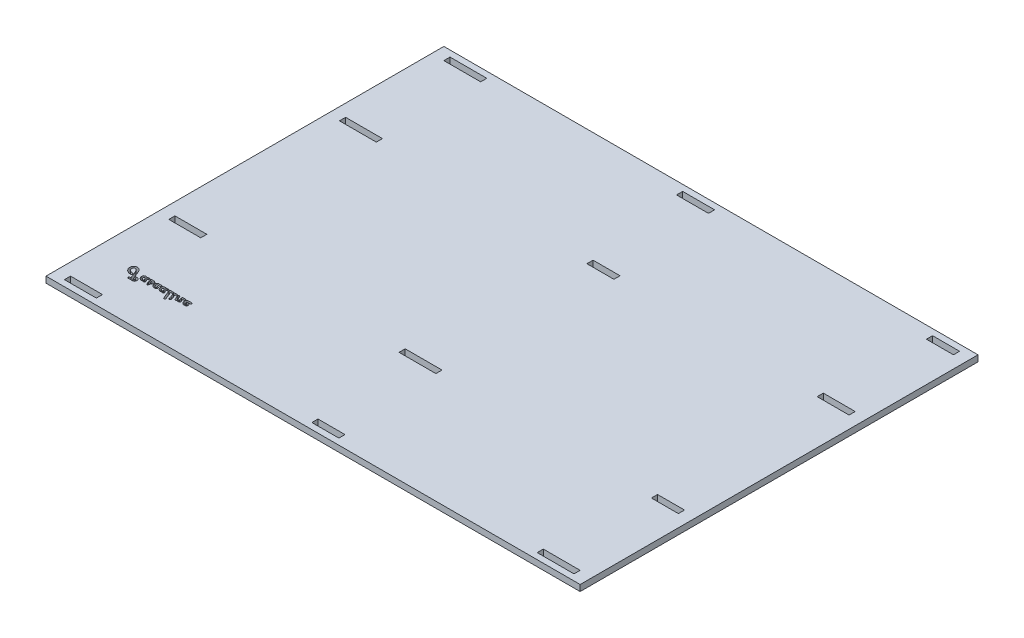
from build123d import *

# Parameters (mm, degrees)
SKETCH1_W           = 276.225
SKETCH1_H           = 205.74
SKETCH1_W_2         = 19.05
SKETCH1_H_2         = 3.175
SKETCH1_W_3         = 16.51
SKETCH1_W_4         = 13.97
BOSS_EXTRUDE1_DEPTH = 3.175
CUT_EXTRUDE1_DEPTH  = 345.440530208


with BuildPart() as part:
    # Sketch1 → Boss-Extrude1 (new body)
    with BuildSketch(Plane(origin=(0, 0, 0), x_dir=(1, 0, 0), z_dir=(0, 1, 0))):
        with Locations((138.1125, -102.87)):
            Rectangle(SKETCH1_W, SKETCH1_H)
        with Locations((15.875, -58.7375)):
            Rectangle(SKETCH1_W_2, SKETCH1_H_2, mode=Mode.SUBTRACT)
        with Locations((15.875, -4.7625)):
            Rectangle(SKETCH1_W_2, SKETCH1_H_2, mode=Mode.SUBTRACT)
        with Locations((134.9375, -4.7625)):
            Rectangle(SKETCH1_W_3, SKETCH1_H_2, mode=Mode.SUBTRACT)
        with Locations((262.89, -4.7625)):
            Rectangle(SKETCH1_W_4, SKETCH1_H_2, mode=Mode.SUBTRACT)
        with Locations((141.2875, -58.7375)):
            Rectangle(SKETCH1_W_4, SKETCH1_H_2, mode=Mode.SUBTRACT)
        with Locations((261.62, -58.7375)):
            Rectangle(SKETCH1_W_3, SKETCH1_H_2, mode=Mode.SUBTRACT)
        with Locations((14.605, -147.0025)):
            Rectangle(SKETCH1_W_3, SKETCH1_H_2, mode=Mode.SUBTRACT)
        with Locations((134.9375, -147.0025)):
            Rectangle(SKETCH1_W_2, SKETCH1_H_2, mode=Mode.SUBTRACT)
        with Locations((262.89, -147.0025)):
            Rectangle(SKETCH1_W_4, SKETCH1_H_2, mode=Mode.SUBTRACT)
        with Locations((14.605, -200.9775)):
            Rectangle(SKETCH1_W_3, SKETCH1_H_2, mode=Mode.SUBTRACT)
        with Locations((141.2875, -200.9775)):
            Rectangle(SKETCH1_W_4, SKETCH1_H_2, mode=Mode.SUBTRACT)
        with Locations((260.35, -200.9775)):
            Rectangle(SKETCH1_W_2, SKETCH1_H_2, mode=Mode.SUBTRACT)
    extrude(amount=BOSS_EXTRUDE1_DEPTH)

    # Sketch2 → Cut-Extrude1 (cut, through all)
    # profile 1 of 10: a face of its own
    with BuildSketch(Plane.XZ):
        with BuildLine():
            Line((23.119201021, 182.79452047), (22.451206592, 181.130477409))
            add(Edge.make_bspline(
                [(22.451206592, 181.130477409), (22.411003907, 181.031340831), (22.333829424, 180.841034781), (22.219435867, 180.568553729), (22.112680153, 180.320023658), (22.012786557, 180.095385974), (21.920717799, 179.893979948), (21.833533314, 179.717428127), (21.755963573, 179.563780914), (21.661354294, 179.39266641), (21.539114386, 179.202342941), (21.375027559, 178.99474829), (21.194459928, 178.802663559), (21.060129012, 178.689800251), (20.992791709, 178.633224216)],
                knots=[0, 0, 0, 0, 1.315970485, 2.526183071, 3.635244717, 4.643279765, 5.550454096, 6.359128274, 7.065363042, 7.667512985, 8.763908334, 9.843272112, 10.918877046, 12, 12, 12, 12], degree=3))
            add(Edge.make_bspline(
                [(20.992791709, 178.633224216), (20.941866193, 178.595142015), (20.841070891, 178.519767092), (20.680401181, 178.421962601), (20.514563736, 178.338383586), (20.341573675, 178.271585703), (20.163005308, 178.219327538), (19.978244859, 178.181172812), (19.787353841, 178.157947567), (19.658056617, 178.155470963), (19.592618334, 178.154217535)],
                knots=[0, 0, 0, 0, 1.011044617, 2.001129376, 2.987597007, 3.961339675, 4.946518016, 5.943976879, 6.959431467, 8, 8, 8, 8], degree=3))
            add(Edge.make_bspline(
                [(19.592618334, 178.154217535), (19.523985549, 178.155689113), (19.389812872, 178.158565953), (19.193870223, 178.18476624), (19.007122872, 178.223973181), (18.83078106, 178.283249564), (18.663334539, 178.356418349), (18.506601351, 178.447809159), (18.35966799, 178.554992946), (18.22480845, 178.678725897), (18.102569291, 178.814608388), (17.996369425, 178.961956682), (17.904994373, 179.118377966), (17.831448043, 179.285592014), (17.774055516, 179.462414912), (17.734367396, 179.648876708), (17.708307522, 179.84486499), (17.70541107, 179.979031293), (17.70392946, 180.047660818)],
                knots=[0, 0, 0, 0, 1.095039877, 2.140732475, 3.150521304, 4.13652018, 5.104897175, 6.062745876, 7.026672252, 8.00261995, 8.979018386, 9.939223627, 10.897072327, 11.865449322, 12.849478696, 13.859267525, 14.904960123, 16, 16, 16, 16], degree=3))
            add(Edge.make_bspline(
                [(17.70392946, 180.047660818), (17.706469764, 180.140106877), (17.711485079, 180.322622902), (17.750571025, 180.591864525), (17.814671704, 180.852395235), (17.905671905, 181.103879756), (18.021297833, 181.346741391), (18.16431112, 181.579480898), (18.332042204, 181.804170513), (18.460931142, 181.943030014), (18.526442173, 182.013608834)],
                knots=[0, 0, 0, 0, 1.01377589, 2.001495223, 2.977585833, 3.952291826, 4.930103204, 5.92294397, 6.944284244, 8, 8, 8, 8], degree=3))
            add(Edge.make_bspline(
                [(18.526442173, 182.013608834), (18.564038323, 182.050924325), (18.639923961, 182.126243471), (18.762383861, 182.231124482), (18.891389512, 182.331316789), (19.026342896, 182.426878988), (19.169837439, 182.513996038), (19.318539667, 182.598384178), (19.475608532, 182.674541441), (19.690708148, 182.771179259), (19.965425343, 182.870917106), (20.2978387, 182.958589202), (20.629749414, 183.011704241), (20.850767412, 183.019068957), (20.96069945, 183.02273209)],
                knots=[0, 0, 0, 0, 0.706155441, 1.425333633, 2.148189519, 2.883981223, 3.628821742, 4.385725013, 5.163077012, 5.955384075, 7.529784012, 9.053423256, 10.534403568, 12, 12, 12, 12], degree=3))
            add(Edge.make_bspline(
                [(20.96069945, 183.02273209), (21.010777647, 183.021540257), (21.10661754, 183.019259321), (21.242284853, 182.990920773), (21.363435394, 182.947665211), (21.467338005, 182.885588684), (21.552788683, 182.809995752), (21.616087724, 182.721046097), (21.653226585, 182.618989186), (21.657440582, 182.547193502), (21.659597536, 182.510444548)],
                knots=[0, 0, 0, 0, 1.238826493, 2.370872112, 3.417595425, 4.41258701, 5.350953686, 6.225146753, 7.091533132, 8, 8, 8, 8], degree=3))
            add(Edge.make_bspline(
                [(21.659597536, 182.510444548), (21.657158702, 182.47167473), (21.65240403, 182.396090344), (21.612518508, 182.288702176), (21.545055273, 182.194477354), (21.48423124, 182.145768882), (21.452780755, 182.120583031)],
                knots=[0, 0, 0, 0, 1.010937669, 1.970891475, 2.950802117, 4, 4, 4, 4], degree=3))
            add(Edge.make_bspline(
                [(21.452780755, 182.120583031), (21.428650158, 182.10617239), (21.374303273, 182.073716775), (21.271172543, 182.042998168), (21.142728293, 182.017208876), (21.04721528, 182.007184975), (20.995168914, 182.001722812)],
                knots=[0, 0, 0, 0, 0.704559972, 1.586808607, 2.68501851, 4, 4, 4, 4], degree=3))
            add(Edge.make_bspline(
                [(20.995168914, 182.001722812), (20.930899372, 181.995250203), (20.80556437, 181.982627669), (20.622961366, 181.953054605), (20.44919412, 181.919845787), (20.285218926, 181.876482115), (20.130183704, 181.827579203), (19.983692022, 181.774036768), (19.847574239, 181.710400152), (19.761927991, 181.662675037), (19.719798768, 181.639199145)],
                knots=[0, 0, 0, 0, 1.159710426, 2.261604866, 3.320677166, 4.335395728, 5.305245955, 6.239579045, 7.134052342, 8, 8, 8, 8], degree=3))
            add(Edge.make_bspline(
                [(19.719798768, 181.639199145), (19.654419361, 181.597250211), (19.52562533, 181.514612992), (19.354426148, 181.363133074), (19.203332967, 181.19487476), (19.075629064, 181.00902045), (18.973627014, 180.811182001), (18.89879096, 180.606164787), (18.852926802, 180.395180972), (18.847636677, 180.252322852), (18.844987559, 180.180784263)],
                knots=[0, 0, 0, 0, 1.047576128, 2.063670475, 3.075290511, 4.094745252, 5.099666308, 6.072755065, 7.034899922, 8, 8, 8, 8], degree=3))
            add(Edge.make_bspline(
                [(18.844987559, 180.180784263), (18.845636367, 180.145096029), (18.846908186, 180.075138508), (18.857899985, 179.973043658), (18.875018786, 179.87615749), (18.901788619, 179.785799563), (18.933862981, 179.700545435), (18.972695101, 179.620297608), (19.020918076, 179.546997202), (19.073977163, 179.478348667), (19.13513267, 179.418352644), (19.199905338, 179.364063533), (19.271326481, 179.320265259), (19.346543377, 179.282611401), (19.427352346, 179.25449148), (19.513023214, 179.234450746), (19.603256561, 179.220494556), (19.665464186, 179.219640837), (19.697215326, 179.219205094)],
                knots=[0, 0, 0, 0, 1.180906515, 2.314860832, 3.395146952, 4.432720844, 5.428859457, 6.408284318, 7.375873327, 8.328235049, 9.274073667, 10.205991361, 11.119268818, 12.040047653, 12.985704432, 13.943108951, 14.9501506, 16, 16, 16, 16], degree=3))
            add(Edge.make_bspline(
                [(19.697215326, 179.219205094), (19.73772721, 179.220089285), (19.817696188, 179.221834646), (19.934736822, 179.243468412), (20.047745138, 179.275266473), (20.156538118, 179.321036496), (20.261491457, 179.379435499), (20.361851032, 179.451340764), (20.457232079, 179.536749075), (20.550130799, 179.635601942), (20.640514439, 179.752163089), (20.735291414, 179.885231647), (20.829339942, 180.040578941), (20.926497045, 180.215206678), (21.026287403, 180.409494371), (21.128874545, 180.623606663), (21.231187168, 180.859081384), (21.299659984, 181.023020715), (21.335109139, 181.107893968)],
                knots=[0, 0, 0, 0, 0.731682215, 1.444313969, 2.14503258, 2.851587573, 3.573238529, 4.31284086, 5.079201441, 5.885132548, 6.76239785, 7.744387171, 8.838039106, 10.04403949, 11.357848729, 12.787140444, 14.336666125, 16, 16, 16, 16], degree=3))
            Line((21.335109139, 181.107893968), (22.730528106, 184.544142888))
            Line((22.730528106, 184.544142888), (22.293122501, 184.544142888))
            add(Edge.make_bspline(
                [(22.293122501, 184.544142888), (22.249482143, 184.54522865), (22.167784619, 184.547261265), (22.053469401, 184.563396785), (21.955911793, 184.590948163), (21.875553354, 184.631358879), (21.812083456, 184.683751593), (21.766552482, 184.748821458), (21.739607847, 184.826228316), (21.737016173, 184.881488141), (21.735668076, 184.910232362)],
                knots=[0, 0, 0, 0, 1.386647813, 2.595892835, 3.659749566, 4.594681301, 5.434731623, 6.248703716, 7.089037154, 8, 8, 8, 8], degree=3))
            add(Edge.make_bspline(
                [(21.735668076, 184.910232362), (21.737604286, 184.951372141), (21.741339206, 185.030730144), (21.780099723, 185.142032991), (21.841922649, 185.23923404), (21.930694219, 185.318386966), (22.040352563, 185.381488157), (22.17060237, 185.426231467), (22.320267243, 185.451690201), (22.426142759, 185.455156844), (22.482110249, 185.456989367)],
                knots=[0, 0, 0, 0, 0.942601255, 1.818263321, 2.674766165, 3.564433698, 4.523656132, 5.566505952, 6.713616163, 8, 8, 8, 8], degree=3))
            Line((22.482110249, 185.456989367), (24.009464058, 185.456989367))
            add(Edge.make_bspline(
                [(24.009464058, 185.456989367), (24.07248493, 185.45605179), (24.194705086, 185.454233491), (24.371659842, 185.440997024), (24.536158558, 185.420336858), (24.687661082, 185.389726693), (24.826003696, 185.349404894), (24.951704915, 185.300515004), (25.065549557, 185.244026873), (25.166457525, 185.176779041), (25.254881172, 185.100669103), (25.331318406, 185.014744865), (25.394973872, 184.919078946), (25.449869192, 184.814945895), (25.489653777, 184.699753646), (25.51766631, 184.575328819), (25.536143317, 184.441676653), (25.53815736, 184.349276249), (25.539195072, 184.301668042)],
                knots=[0, 0, 0, 0, 1.377685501, 2.671828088, 3.877302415, 5.000186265, 6.047243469, 7.023626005, 7.94558449, 8.820055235, 9.667510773, 10.489711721, 11.325757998, 12.174186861, 13.056345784, 13.980864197, 14.959664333, 16, 16, 16, 16], degree=3))
            add(Edge.make_bspline(
                [(25.539195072, 184.301668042), (25.537217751, 184.24294268), (25.533336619, 184.127675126), (25.507219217, 183.958719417), (25.461558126, 183.798497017), (25.398541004, 183.64601214), (25.315426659, 183.503066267), (25.215734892, 183.367351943), (25.098243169, 183.239446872), (25.007634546, 183.164349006), (24.961534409, 183.12614048)],
                knots=[0, 0, 0, 0, 1.037190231, 2.03582197, 3.010506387, 3.973515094, 4.942177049, 5.923321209, 6.943420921, 8, 8, 8, 8], degree=3))
            add(Edge.make_bspline(
                [(24.961534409, 183.12614048), (24.924861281, 183.099501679), (24.849567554, 183.044809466), (24.722279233, 182.977706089), (24.581294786, 182.920538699), (24.42582274, 182.874856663), (24.257052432, 182.838032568), (24.073914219, 182.812269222), (23.876613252, 182.796761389), (23.740077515, 182.795283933), (23.669523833, 182.79452047)],
                knots=[0, 0, 0, 0, 0.800437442, 1.643380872, 2.535600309, 3.486195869, 4.50417187, 5.586788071, 6.752993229, 8, 8, 8, 8], degree=3))
            Line((23.669523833, 182.79452047), (23.119201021, 182.79452047))
        make_face()
        with BuildLine():
            Line((23.509062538, 183.707366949), (23.833550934, 183.707366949))
            add(Edge.make_bspline(
                [(23.833550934, 183.707366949), (23.883581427, 183.708782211), (23.978009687, 183.711453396), (24.109812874, 183.735741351), (24.222265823, 183.777278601), (24.315221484, 183.83600151), (24.38842248, 183.91333287), (24.437974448, 184.00899527), (24.470358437, 184.119724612), (24.47287967, 184.199195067), (24.474207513, 184.241049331)],
                knots=[0, 0, 0, 0, 1.258971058, 2.376199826, 3.358208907, 4.260347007, 5.121448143, 6.005251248, 6.949436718, 8, 8, 8, 8], degree=3))
            add(Edge.make_bspline(
                [(24.474207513, 184.241049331), (24.473067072, 184.264903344), (24.470906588, 184.310093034), (24.45485612, 184.373529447), (24.424912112, 184.426356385), (24.384765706, 184.471207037), (24.331090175, 184.503760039), (24.267531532, 184.527978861), (24.192697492, 184.541857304), (24.139079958, 184.543348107), (24.110495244, 184.544142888)],
                knots=[0, 0, 0, 0, 1.057975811, 2.004258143, 2.869579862, 3.727735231, 4.644179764, 5.623179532, 6.73286349, 8, 8, 8, 8], degree=3))
            Line((24.110495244, 184.544142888), (23.84187115, 184.544142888))
            Line((23.84187115, 184.544142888), (23.509062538, 183.707366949))
        make_face(mode=Mode.SUBTRACT)
    # profile 2 of 10: a face of its own
    with BuildSketch(Plane.XZ):
        with BuildLine():
            Line((27.590722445, 180.892756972), (28.032882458, 180.892756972))
            add(Edge.make_bspline(
                [(28.032882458, 180.892756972), (28.069771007, 180.891594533), (28.139217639, 180.889406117), (28.237100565, 180.873955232), (28.319497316, 180.843823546), (28.389453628, 180.805117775), (28.441730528, 180.750669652), (28.479643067, 180.685580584), (28.502815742, 180.608611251), (28.504866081, 180.553382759), (28.505946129, 180.524290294)],
                knots=[0, 0, 0, 0, 1.294214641, 2.436497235, 3.45633191, 4.35958604, 5.214514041, 6.067746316, 6.982155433, 8, 8, 8, 8], degree=3))
            add(Edge.make_bspline(
                [(28.505946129, 180.524290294), (28.504075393, 180.483662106), (28.500488, 180.405751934), (28.467922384, 180.295389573), (28.411237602, 180.200597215), (28.335484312, 180.119531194), (28.239850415, 180.056616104), (28.127852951, 180.010515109), (27.999107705, 179.985437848), (27.90818237, 179.981811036), (27.860535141, 179.979910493)],
                knots=[0, 0, 0, 0, 1.02006706, 1.956119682, 2.85821293, 3.77438774, 4.72208319, 5.713685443, 6.801912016, 8, 8, 8, 8], degree=3))
            Line((27.860535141, 179.979910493), (27.347058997, 179.979910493))
            add(Edge.make_bspline(
                [(27.347058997, 179.979910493), (27.319272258, 179.980834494), (27.266140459, 179.982601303), (27.189661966, 179.995720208), (27.119931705, 180.018400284), (27.056725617, 180.050207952), (27.001086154, 180.09183418), (26.951568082, 180.140920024), (26.909321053, 180.199999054), (26.888358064, 180.244587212), (26.877561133, 180.267552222)],
                knots=[0, 0, 0, 0, 1.135602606, 2.17141737, 3.159933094, 4.123316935, 5.049777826, 5.988893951, 6.964185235, 8, 8, 8, 8], degree=3))
            add(Edge.make_bspline(
                [(26.877561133, 180.267552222), (26.829418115, 180.223702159), (26.738706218, 180.141079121), (26.589078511, 180.051827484), (26.442765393, 179.990628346), (26.343224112, 179.983401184), (26.295146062, 179.979910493)],
                knots=[0, 0, 0, 0, 1.172355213, 2.208971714, 3.134940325, 4, 4, 4, 4], degree=3))
            Line((26.295146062, 179.979910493), (25.838722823, 179.979910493))
            add(Edge.make_bspline(
                [(25.838722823, 179.979910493), (25.802613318, 179.98075717), (25.732080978, 179.982410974), (25.629021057, 179.997305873), (25.530996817, 180.02024658), (25.439134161, 180.055821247), (25.351766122, 180.098131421), (25.269891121, 180.15116498), (25.194345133, 180.214399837), (25.123714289, 180.285630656), (25.061392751, 180.365631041), (25.004824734, 180.450840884), (24.958631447, 180.543303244), (24.9203783, 180.641169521), (24.891018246, 180.744712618), (24.869013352, 180.853918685), (24.857836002, 180.969387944), (24.855668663, 181.048444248), (24.854560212, 181.088876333)],
                knots=[0, 0, 0, 0, 1.038881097, 2.029236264, 2.991883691, 3.930308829, 4.858629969, 5.782385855, 6.730121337, 7.689859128, 8.664191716, 9.644845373, 10.629272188, 11.633194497, 12.665607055, 13.723595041, 14.835769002, 16, 16, 16, 16], degree=3))
            add(Edge.make_bspline(
                [(24.854560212, 181.088876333), (24.85610135, 181.15077263), (24.859147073, 181.27309718), (24.885247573, 181.454146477), (24.926425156, 181.630157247), (24.985151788, 181.801314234), (25.060821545, 181.966769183), (25.150817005, 182.128417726), (25.260719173, 182.283187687), (25.383466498, 182.432189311), (25.517065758, 182.569321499), (25.65634466, 182.690858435), (25.801550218, 182.79213683), (25.949498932, 182.87771364), (26.103529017, 182.942119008), (26.26118757, 182.989085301), (26.423717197, 183.016977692), (26.533554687, 183.020807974), (26.588730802, 183.02273209)],
                knots=[0, 0, 0, 0, 1.038393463, 2.052158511, 3.063456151, 4.068635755, 5.08344709, 6.113632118, 7.168837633, 8.264602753, 9.350863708, 10.378663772, 11.361961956, 12.31789787, 13.241700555, 14.156967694, 15.07416527, 16, 16, 16, 16], degree=3))
            add(Edge.make_bspline(
                [(26.588730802, 183.02273209), (26.629955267, 183.021712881), (26.709847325, 183.019737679), (26.825936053, 183.007573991), (26.93284671, 182.982630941), (27.032648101, 182.953341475), (27.12225627, 182.910617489), (27.204008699, 182.860644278), (27.277694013, 182.801379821), (27.318416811, 182.753986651), (27.338738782, 182.730335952)],
                knots=[0, 0, 0, 0, 1.187749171, 2.30183041, 3.353985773, 4.346587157, 5.291117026, 6.203238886, 7.103359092, 8, 8, 8, 8], degree=3))
            add(Edge.make_bspline(
                [(27.338738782, 182.730335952), (27.355674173, 182.753711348), (27.388572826, 182.799120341), (27.444893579, 182.858946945), (27.505129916, 182.909541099), (27.568893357, 182.951846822), (27.638154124, 182.982068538), (27.709275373, 183.007094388), (27.78560771, 183.019744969), (27.837518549, 183.021720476), (27.864100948, 183.02273209)],
                knots=[0, 0, 0, 0, 1.102961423, 2.142610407, 3.131917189, 4.106850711, 5.056016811, 6.014208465, 6.983119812, 8, 8, 8, 8], degree=3))
            add(Edge.make_bspline(
                [(27.864100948, 183.02273209), (27.892332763, 183.021284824), (27.947568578, 183.018453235), (28.026788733, 182.99865781), (28.097661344, 182.962530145), (28.159912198, 182.915388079), (28.212990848, 182.859045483), (28.25007614, 182.793239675), (28.274365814, 182.721313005), (28.276592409, 182.670711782), (28.277734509, 182.644756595)],
                knots=[0, 0, 0, 0, 1.085152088, 2.123110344, 3.11068521, 4.121931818, 5.11360817, 6.061884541, 7.005870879, 8, 8, 8, 8], degree=3))
            add(Edge.make_bspline(
                [(28.277734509, 182.644756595), (28.277038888, 182.625686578), (28.275563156, 182.585230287), (28.262690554, 182.522308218), (28.242496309, 182.454251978), (28.223506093, 182.40846021), (28.213549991, 182.384452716)],
                knots=[0, 0, 0, 0, 0.847236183, 1.797378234, 2.845219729, 4, 4, 4, 4], degree=3))
            Line((28.213549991, 182.384452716), (28.16957171, 182.278667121))
            Line((28.16957171, 182.278667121), (27.590722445, 180.892756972))
        make_face()
        with BuildLine():
            Line((26.134684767, 180.892756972), (26.235715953, 180.892756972))
            add(Edge.make_bspline(
                [(26.235715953, 180.892756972), (26.261118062, 180.893313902), (26.310245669, 180.894391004), (26.380704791, 180.906223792), (26.444219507, 180.926536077), (26.501442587, 180.954060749), (26.551533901, 180.989991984), (26.595304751, 181.033437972), (26.631459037, 181.085632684), (26.649532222, 181.124621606), (26.658858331, 181.144740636)],
                knots=[0, 0, 0, 0, 1.157664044, 2.238919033, 3.244614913, 4.190073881, 5.122668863, 6.042574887, 6.989931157, 8, 8, 8, 8], degree=3))
            Line((26.658858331, 181.144740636), (26.92985963, 181.796094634))
            add(Edge.make_bspline(
                [(26.92985963, 181.796094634), (26.946051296, 181.834756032), (26.974847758, 181.903514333), (26.981585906, 181.977609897), (26.98453533, 182.010043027)],
                knots=[0, 0, 0, 0, 1.124559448, 2, 2, 2, 2], degree=3))
            add(Edge.make_bspline(
                [(26.98453533, 182.010043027), (26.982919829, 182.026420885), (26.979660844, 182.059460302), (26.960273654, 182.107946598), (26.923140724, 182.149283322), (26.877468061, 182.188201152), (26.822149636, 182.221159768), (26.759781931, 182.244753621), (26.692035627, 182.2595835), (26.645070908, 182.261194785), (26.620823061, 182.262026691)],
                knots=[0, 0, 0, 0, 0.81058345, 1.635208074, 2.524363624, 3.523748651, 4.593951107, 5.683817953, 6.804157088, 8, 8, 8, 8], degree=3))
            add(Edge.make_bspline(
                [(26.620823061, 182.262026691), (26.596174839, 182.261194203), (26.546394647, 182.25951289), (26.472572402, 182.243028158), (26.399545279, 182.218040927), (26.327079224, 182.182654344), (26.255132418, 182.137487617), (26.183183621, 182.082509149), (26.113420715, 182.016225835), (26.021876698, 181.918994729), (25.923002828, 181.78794112), (25.834330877, 181.622275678), (25.778103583, 181.452594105), (25.770947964, 181.337299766), (25.767406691, 181.280241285)],
                knots=[0, 0, 0, 0, 0.627706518, 1.267732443, 1.919531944, 2.592823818, 3.31892668, 4.082778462, 4.897707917, 5.769757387, 7.487317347, 9.064628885, 10.547302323, 12, 12, 12, 12], degree=3))
            add(Edge.make_bspline(
                [(25.767406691, 181.280241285), (25.768547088, 181.250053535), (25.770712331, 181.192736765), (25.786711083, 181.1124477), (25.814989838, 181.043784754), (25.857126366, 180.988202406), (25.910530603, 180.944732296), (25.97542406, 180.913075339), (26.051786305, 180.895788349), (26.106072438, 180.893803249), (26.134684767, 180.892756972)],
                knots=[0, 0, 0, 0, 1.183693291, 2.247450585, 3.194323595, 4.070859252, 4.954393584, 5.871857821, 6.878330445, 8, 8, 8, 8], degree=3))
        make_face(mode=Mode.SUBTRACT)
    # profile 3 of 10: a face of its own
    with BuildSketch(Plane.XZ):
        with BuildLine():
            Line((29.990510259, 181.960121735), (29.912062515, 181.790151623))
            add(Edge.make_bspline(
                [(29.912062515, 181.790151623), (29.896884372, 181.761223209), (29.86769618, 181.705592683), (29.814544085, 181.631320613), (29.757815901, 181.56745055), (29.695046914, 181.515760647), (29.628129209, 181.474518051), (29.555769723, 181.445719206), (29.478606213, 181.428787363), (29.425612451, 181.426445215), (29.39858637, 181.425250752)],
                knots=[0, 0, 0, 0, 1.174117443, 2.257875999, 3.277186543, 4.239058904, 5.172954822, 6.09414408, 7.028039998, 8, 8, 8, 8], degree=3))
            add(Edge.make_bspline(
                [(29.39858637, 181.425250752), (29.371134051, 181.426706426), (29.316667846, 181.429594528), (29.237096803, 181.450224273), (29.16263589, 181.485549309), (29.09462143, 181.532339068), (29.037107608, 181.588014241), (28.993789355, 181.649788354), (28.967174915, 181.716793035), (28.963967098, 181.763381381), (28.962369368, 181.786585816)],
                knots=[0, 0, 0, 0, 1.057292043, 2.097698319, 3.142574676, 4.21811325, 5.26521749, 6.20945791, 7.108177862, 8, 8, 8, 8], degree=3))
            add(Edge.make_bspline(
                [(28.962369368, 181.786585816), (28.963902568, 181.810895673), (28.967274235, 181.864355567), (28.992789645, 181.948344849), (29.027799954, 182.044307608), (29.061029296, 182.109427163), (29.078852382, 182.144355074)],
                knots=[0, 0, 0, 0, 0.768398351, 1.68978755, 2.760880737, 4, 4, 4, 4], degree=3))
            Line((29.078852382, 182.144355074), (29.612534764, 183.182004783))
            add(Edge.make_bspline(
                [(29.612534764, 183.182004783), (29.628998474, 183.211670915), (29.660355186, 183.268172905), (29.714608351, 183.34426393), (29.771846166, 183.408508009), (29.830813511, 183.463301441), (29.894697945, 183.504104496), (29.961322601, 183.533051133), (30.030689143, 183.551884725), (30.078349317, 183.554110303), (30.102238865, 183.555225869)],
                knots=[0, 0, 0, 0, 1.254889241, 2.390056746, 3.44940031, 4.435704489, 5.358962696, 6.23882182, 7.117213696, 8, 8, 8, 8], degree=3))
            add(Edge.make_bspline(
                [(30.102238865, 183.555225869), (30.127723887, 183.554244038), (30.177477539, 183.552327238), (30.249027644, 183.532558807), (30.314253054, 183.499927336), (30.371649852, 183.455530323), (30.422350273, 183.405018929), (30.456581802, 183.345159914), (30.480139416, 183.28158863), (30.482550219, 183.23689759), (30.483780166, 183.214097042)],
                knots=[0, 0, 0, 0, 1.076175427, 2.100985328, 3.113101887, 4.142426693, 5.162150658, 6.116677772, 7.039163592, 8, 8, 8, 8], degree=3))
            add(Edge.make_bspline(
                [(30.483780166, 183.214097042), (30.483189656, 183.206535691), (30.481707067, 183.187551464), (30.472108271, 183.154321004), (30.457923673, 183.110327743), (30.445526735, 183.077747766), (30.438613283, 183.059578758)],
                knots=[0, 0, 0, 0, 0.562304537, 1.411773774, 2.556613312, 4, 4, 4, 4], degree=3))
            add(Edge.make_bspline(
                [(30.438613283, 183.059578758), (30.429934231, 183.032065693), (30.4139082, 182.981262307), (30.409658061, 182.928198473), (30.407709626, 182.903871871)],
                knots=[0, 0, 0, 0, 1.083119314, 2, 2, 2, 2], degree=3))
            add(Edge.make_bspline(
                [(30.407709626, 182.903871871), (30.410360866, 182.861582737), (30.41576673, 182.775355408), (30.457407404, 182.64653534), (30.521341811, 182.516045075), (30.581783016, 182.435055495), (30.613337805, 182.392772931)],
                knots=[0, 0, 0, 0, 0.903479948, 1.84219102, 2.873463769, 4, 4, 4, 4], degree=3))
            Line((30.613337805, 182.392772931), (30.862944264, 182.078981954))
            add(Edge.make_bspline(
                [(30.862944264, 182.078981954), (30.89315876, 182.039323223), (30.95181765, 181.962329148), (31.029517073, 181.84355279), (31.096639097, 181.726600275), (31.150204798, 181.609464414), (31.192582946, 181.493521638), (31.222000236, 181.378436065), (31.241056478, 181.264233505), (31.243346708, 181.188395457), (31.244485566, 181.150683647)],
                knots=[0, 0, 0, 0, 1.169686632, 2.270847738, 3.328397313, 4.331060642, 5.289870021, 6.221237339, 7.115478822, 8, 8, 8, 8], degree=3))
            add(Edge.make_bspline(
                [(31.244485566, 181.150683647), (31.243374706, 181.109809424), (31.241185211, 181.029246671), (31.222953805, 180.911259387), (31.193158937, 180.79845238), (31.151222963, 180.690841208), (31.097710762, 180.58819061), (31.031457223, 180.491251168), (30.953690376, 180.399354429), (30.865170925, 180.313590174), (30.768195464, 180.234785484), (30.663003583, 180.167811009), (30.55370701, 180.108252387), (30.437152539, 180.062572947), (30.315721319, 180.025019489), (30.188203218, 179.99984317), (30.055210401, 179.981754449), (29.964426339, 179.980534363), (29.918005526, 179.979910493)],
                knots=[0, 0, 0, 0, 0.993241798, 1.957671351, 2.894532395, 3.824635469, 4.759513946, 5.702543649, 6.673110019, 7.681185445, 8.695042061, 9.70491044, 10.708882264, 11.715852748, 12.742665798, 13.794825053, 14.872423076, 16, 16, 16, 16], degree=3))
            Line((29.918005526, 179.979910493), (29.080040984, 179.979910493))
            add(Edge.make_bspline(
                [(29.080040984, 179.979910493), (29.041166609, 179.981059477), (28.968164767, 179.983217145), (28.865667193, 179.998710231), (28.778850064, 180.028517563), (28.70672086, 180.068926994), (28.649687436, 180.12138835), (28.609138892, 180.186520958), (28.58673032, 180.26416277), (28.583643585, 180.319310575), (28.582016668, 180.348377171)],
                knots=[0, 0, 0, 0, 1.323532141, 2.485449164, 3.513452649, 4.431917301, 5.281225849, 6.123328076, 7.010867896, 8, 8, 8, 8], degree=3))
            add(Edge.make_bspline(
                [(28.582016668, 180.348377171), (28.583766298, 180.389042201), (28.587126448, 180.46713907), (28.621444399, 180.577312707), (28.678777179, 180.672470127), (28.758030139, 180.752372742), (28.857096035, 180.814960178), (28.972704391, 180.862237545), (29.105937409, 180.887233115), (29.199599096, 180.890854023), (29.248822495, 180.892756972)],
                knots=[0, 0, 0, 0, 1.001377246, 1.923137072, 2.813709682, 3.719614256, 4.674449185, 5.687788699, 6.784829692, 8, 8, 8, 8], degree=3))
            Line((29.248822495, 180.892756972), (29.71356595, 180.892756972))
            add(Edge.make_bspline(
                [(29.71356595, 180.892756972), (29.761976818, 180.893625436), (29.852890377, 180.895256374), (29.979460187, 180.914077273), (30.087169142, 180.944192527), (30.176102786, 180.986785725), (30.246912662, 181.042415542), (30.297305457, 181.11227934), (30.326991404, 181.195600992), (30.330040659, 181.255030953), (30.331639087, 181.286184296)],
                knots=[0, 0, 0, 0, 1.402558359, 2.633945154, 3.698995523, 4.63394819, 5.475307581, 6.281836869, 7.099334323, 8, 8, 8, 8], degree=3))
            add(Edge.make_bspline(
                [(30.331639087, 181.286184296), (30.329759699, 181.311301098), (30.325750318, 181.36488389), (30.29981842, 181.447162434), (30.260510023, 181.536033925), (30.223911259, 181.594082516), (30.204458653, 181.624935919)],
                knots=[0, 0, 0, 0, 0.822745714, 1.755200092, 2.806866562, 4, 4, 4, 4], degree=3))
            Line((30.204458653, 181.624935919), (29.990510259, 181.960121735))
        make_face()
    # profile 4 of 10: a face of its own
    with BuildSketch(Plane.XZ):
        with BuildLine():
            Line((33.843958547, 179.979910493), (32.680317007, 179.979910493))
            add(Edge.make_bspline(
                [(32.680317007, 179.979910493), (32.639473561, 179.981241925), (32.559475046, 179.983849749), (32.442122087, 179.998716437), (32.331089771, 180.0271595), (32.224677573, 180.062769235), (32.125228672, 180.112887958), (32.031435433, 180.171915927), (31.943344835, 180.242045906), (31.862148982, 180.322207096), (31.788904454, 180.411284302), (31.723642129, 180.506584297), (31.67087138, 180.60986109), (31.624984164, 180.717896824), (31.590247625, 180.833058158), (31.567630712, 180.954691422), (31.550914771, 181.082080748), (31.549492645, 181.169247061), (31.548767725, 181.213679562)],
                knots=[0, 0, 0, 0, 1.04308008, 2.043041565, 3.012085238, 3.965374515, 4.901770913, 5.84746328, 6.790555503, 7.770466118, 8.754752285, 9.731054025, 10.712842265, 11.710345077, 12.724731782, 13.776116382, 14.86638876, 16, 16, 16, 16], degree=3))
            add(Edge.make_bspline(
                [(31.548767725, 181.213679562), (31.550434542, 181.273580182), (31.553726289, 181.391876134), (31.577855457, 181.566355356), (31.618616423, 181.735091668), (31.675046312, 181.898009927), (31.750410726, 182.053684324), (31.839361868, 182.204302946), (31.946140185, 182.348058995), (32.065971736, 182.485099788), (32.19833574, 182.609645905), (32.336825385, 182.720828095), (32.481896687, 182.814219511), (32.632077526, 182.891287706), (32.789231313, 182.949159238), (32.951349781, 182.992726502), (33.119703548, 183.017941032), (33.233728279, 183.021125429), (33.29125853, 183.02273209)],
                knots=[0, 0, 0, 0, 1.033018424, 2.040077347, 3.031267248, 4.023304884, 5.007568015, 6.009629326, 7.036117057, 8.091719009, 9.145549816, 10.16692925, 11.15074152, 12.116516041, 13.072326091, 14.033738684, 15.007938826, 16, 16, 16, 16], degree=3))
            add(Edge.make_bspline(
                [(33.29125853, 183.02273209), (33.330123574, 183.022201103), (33.406065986, 183.021163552), (33.516835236, 183.008592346), (33.62234278, 182.990134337), (33.721984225, 182.96247458), (33.816684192, 182.928486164), (33.904919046, 182.884844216), (33.988753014, 182.835376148), (34.065535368, 182.776951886), (34.135215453, 182.713346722), (34.197063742, 182.645128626), (34.248354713, 182.571064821), (34.289538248, 182.492054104), (34.324343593, 182.409440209), (34.345526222, 182.321066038), (34.361010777, 182.228494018), (34.362575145, 182.165028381), (34.363377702, 182.132469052)],
                knots=[0, 0, 0, 0, 1.192851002, 2.330834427, 3.419016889, 4.478598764, 5.502444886, 6.503631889, 7.49680333, 8.487139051, 9.460210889, 10.390750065, 11.308717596, 12.217610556, 13.123567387, 14.053072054, 15.001181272, 16, 16, 16, 16], degree=3))
            add(Edge.make_bspline(
                [(34.363377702, 182.132469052), (34.361783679, 182.088294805), (34.358716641, 182.003299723), (34.328641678, 181.882188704), (34.283123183, 181.771886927), (34.216010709, 181.677194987), (34.135293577, 181.598943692), (34.041830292, 181.541521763), (33.936681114, 181.506671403), (33.862847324, 181.503136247), (33.824940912, 181.501321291)],
                knots=[0, 0, 0, 0, 1.140049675, 2.193554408, 3.207776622, 4.208142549, 5.171800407, 6.095933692, 7.022448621, 8, 8, 8, 8], degree=3))
            add(Edge.make_bspline(
                [(33.824940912, 181.501321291), (33.795542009, 181.502065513), (33.740311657, 181.503463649), (33.663568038, 181.517996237), (33.597715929, 181.539705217), (33.543778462, 181.572701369), (33.500419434, 181.614701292), (33.471820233, 181.668417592), (33.453420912, 181.729915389), (33.451523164, 181.774157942), (33.450531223, 181.797283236)],
                knots=[0, 0, 0, 0, 1.293872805, 2.430738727, 3.43019671, 4.33150824, 5.195698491, 6.055468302, 6.983605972, 8, 8, 8, 8], degree=3))
            add(Edge.make_bspline(
                [(33.450531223, 181.797283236), (33.450531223, 181.811150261), (33.450531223, 181.836507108), (33.450531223, 181.861863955), (33.450531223, 181.873353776)],
                knots=[0, 0, 0, 0, 1.09375, 2, 2, 2, 2], degree=3))
            add(Edge.make_bspline(
                [(33.450531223, 181.873353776), (33.450531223, 181.885635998), (33.450531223, 181.909408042), (33.450531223, 181.933180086), (33.450531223, 181.944669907)],
                knots=[0, 0, 0, 0, 1.033333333, 2, 2, 2, 2], degree=3))
            add(Edge.make_bspline(
                [(33.450531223, 181.944669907), (33.44967953, 181.963786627), (33.448077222, 181.999751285), (33.434613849, 182.049827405), (33.413511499, 182.092997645), (33.380914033, 182.127461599), (33.339478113, 182.153648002), (33.289753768, 182.17243143), (33.231618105, 182.184660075), (33.189901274, 182.185505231), (33.167643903, 182.185956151)],
                knots=[0, 0, 0, 0, 1.076936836, 2.026062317, 2.906040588, 3.760364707, 4.665822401, 5.649858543, 6.746118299, 8, 8, 8, 8], degree=3))
            add(Edge.make_bspline(
                [(33.167643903, 182.185956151), (33.123621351, 182.183073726), (33.034942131, 182.177267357), (32.906677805, 182.12582123), (32.786484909, 182.043681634), (32.676556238, 181.934796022), (32.583034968, 181.807609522), (32.511892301, 181.669296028), (32.470278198, 181.521520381), (32.464516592, 181.420350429), (32.461614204, 181.369386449)],
                knots=[0, 0, 0, 0, 0.889989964, 1.79279967, 2.759962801, 3.828151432, 4.914528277, 5.949409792, 6.967022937, 8, 8, 8, 8], degree=3))
            add(Edge.make_bspline(
                [(32.461614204, 181.369386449), (32.463855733, 181.329158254), (32.468094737, 181.253081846), (32.500732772, 181.146959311), (32.560782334, 181.061566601), (32.643809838, 180.993889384), (32.755272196, 180.946988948), (32.894754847, 180.915809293), (33.064490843, 180.896235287), (33.187790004, 180.89397712), (33.254411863, 180.892756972)],
                knots=[0, 0, 0, 0, 0.913027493, 1.726645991, 2.482782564, 3.249916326, 4.127695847, 5.201188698, 6.487726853, 8, 8, 8, 8], degree=3))
            Line((33.254411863, 180.892756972), (34.012740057, 180.892756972))
            add(Edge.make_bspline(
                [(34.012740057, 180.892756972), (34.052054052, 180.891816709), (34.125991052, 180.890048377), (34.229054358, 180.871956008), (34.317391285, 180.844728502), (34.390470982, 180.803383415), (34.447565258, 180.7492406), (34.488145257, 180.682839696), (34.510965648, 180.604575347), (34.513940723, 180.549009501), (34.515518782, 180.519535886)],
                knots=[0, 0, 0, 0, 1.322009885, 2.486276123, 3.511116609, 4.419281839, 5.287086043, 6.131096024, 7.008683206, 8, 8, 8, 8], degree=3))
            add(Edge.make_bspline(
                [(34.515518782, 180.519535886), (34.513867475, 180.47962238), (34.510676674, 180.402498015), (34.474586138, 180.294327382), (34.416987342, 180.199146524), (34.336227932, 180.119497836), (34.236195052, 180.056518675), (34.119790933, 180.010756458), (33.986884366, 179.985331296), (33.893195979, 179.98177794), (33.843958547, 179.979910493)],
                knots=[0, 0, 0, 0, 0.982987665, 1.899414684, 2.782606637, 3.710260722, 4.674394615, 5.685217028, 6.783478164, 8, 8, 8, 8], degree=3))
        make_face()
    # profile 5 of 10: a face of its own
    with BuildSketch(Plane.XZ):
        with BuildLine():
            Line((37.403822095, 180.892756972), (37.845982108, 180.892756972))
            add(Edge.make_bspline(
                [(37.845982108, 180.892756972), (37.882870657, 180.891594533), (37.952317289, 180.889406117), (38.050200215, 180.873955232), (38.132596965, 180.843823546), (38.202553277, 180.805117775), (38.254830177, 180.750669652), (38.292742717, 180.685580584), (38.315915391, 180.608611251), (38.31796573, 180.553382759), (38.319045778, 180.524290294)],
                knots=[0, 0, 0, 0, 1.294214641, 2.436497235, 3.45633191, 4.35958604, 5.214514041, 6.067746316, 6.982155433, 8, 8, 8, 8], degree=3))
            add(Edge.make_bspline(
                [(38.319045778, 180.524290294), (38.317175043, 180.483662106), (38.313587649, 180.405751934), (38.281022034, 180.295389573), (38.224337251, 180.200597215), (38.148583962, 180.119531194), (38.052950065, 180.056616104), (37.9409526, 180.010515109), (37.812207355, 179.985437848), (37.721282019, 179.981811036), (37.673634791, 179.979910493)],
                knots=[0, 0, 0, 0, 1.02006706, 1.956119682, 2.85821293, 3.77438774, 4.72208319, 5.713685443, 6.801912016, 8, 8, 8, 8], degree=3))
            Line((37.673634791, 179.979910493), (37.160158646, 179.979910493))
            add(Edge.make_bspline(
                [(37.160158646, 179.979910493), (37.132371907, 179.980834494), (37.079240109, 179.982601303), (37.002761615, 179.995720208), (36.933031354, 180.018400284), (36.869825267, 180.050207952), (36.814185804, 180.09183418), (36.764667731, 180.140920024), (36.722420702, 180.199999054), (36.701457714, 180.244587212), (36.690660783, 180.267552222)],
                knots=[0, 0, 0, 0, 1.135602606, 2.17141737, 3.159933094, 4.123316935, 5.049777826, 5.988893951, 6.964185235, 8, 8, 8, 8], degree=3))
            add(Edge.make_bspline(
                [(36.690660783, 180.267552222), (36.642517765, 180.223702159), (36.551805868, 180.141079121), (36.402178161, 180.051827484), (36.255865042, 179.990628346), (36.156323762, 179.983401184), (36.108245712, 179.979910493)],
                knots=[0, 0, 0, 0, 1.172355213, 2.208971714, 3.134940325, 4, 4, 4, 4], degree=3))
            Line((36.108245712, 179.979910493), (35.651822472, 179.979910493))
            add(Edge.make_bspline(
                [(35.651822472, 179.979910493), (35.615712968, 179.98075717), (35.545180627, 179.982410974), (35.442120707, 179.997305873), (35.344096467, 180.02024658), (35.252233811, 180.055821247), (35.164865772, 180.098131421), (35.082990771, 180.15116498), (35.007444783, 180.214399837), (34.936813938, 180.285630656), (34.8744924, 180.365631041), (34.817924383, 180.450840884), (34.771731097, 180.543303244), (34.733477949, 180.641169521), (34.704117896, 180.744712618), (34.682113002, 180.853918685), (34.670935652, 180.969387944), (34.668768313, 181.048444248), (34.667659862, 181.088876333)],
                knots=[0, 0, 0, 0, 1.038881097, 2.029236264, 2.991883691, 3.930308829, 4.858629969, 5.782385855, 6.730121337, 7.689859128, 8.664191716, 9.644845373, 10.629272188, 11.633194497, 12.665607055, 13.723595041, 14.835769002, 16, 16, 16, 16], degree=3))
            add(Edge.make_bspline(
                [(34.667659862, 181.088876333), (34.669201, 181.15077263), (34.672246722, 181.27309718), (34.698347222, 181.454146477), (34.739524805, 181.630157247), (34.798251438, 181.801314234), (34.873921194, 181.966769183), (34.963916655, 182.128417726), (35.073818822, 182.283187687), (35.196566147, 182.432189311), (35.330165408, 182.569321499), (35.46944431, 182.690858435), (35.614649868, 182.79213683), (35.762598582, 182.87771364), (35.916628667, 182.942119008), (36.07428722, 182.989085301), (36.236816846, 183.016977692), (36.346654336, 183.020807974), (36.401830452, 183.02273209)],
                knots=[0, 0, 0, 0, 1.038393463, 2.052158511, 3.063456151, 4.068635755, 5.08344709, 6.113632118, 7.168837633, 8.264602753, 9.350863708, 10.378663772, 11.361961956, 12.31789787, 13.241700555, 14.156967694, 15.07416527, 16, 16, 16, 16], degree=3))
            add(Edge.make_bspline(
                [(36.401830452, 183.02273209), (36.443054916, 183.021712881), (36.522946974, 183.019737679), (36.639035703, 183.007573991), (36.74594636, 182.982630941), (36.845747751, 182.953341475), (36.935355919, 182.910617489), (37.017108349, 182.860644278), (37.090793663, 182.801379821), (37.131516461, 182.753986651), (37.151838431, 182.730335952)],
                knots=[0, 0, 0, 0, 1.187749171, 2.30183041, 3.353985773, 4.346587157, 5.291117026, 6.203238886, 7.103359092, 8, 8, 8, 8], degree=3))
            add(Edge.make_bspline(
                [(37.151838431, 182.730335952), (37.168773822, 182.753711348), (37.201672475, 182.799120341), (37.257993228, 182.858946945), (37.318229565, 182.909541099), (37.381993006, 182.951846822), (37.451253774, 182.982068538), (37.522375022, 183.007094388), (37.598707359, 183.019744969), (37.650618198, 183.021720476), (37.677200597, 183.02273209)],
                knots=[0, 0, 0, 0, 1.102961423, 2.142610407, 3.131917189, 4.106850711, 5.056016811, 6.014208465, 6.983119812, 8, 8, 8, 8], degree=3))
            add(Edge.make_bspline(
                [(37.677200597, 183.02273209), (37.705432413, 183.021284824), (37.760668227, 183.018453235), (37.839888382, 182.99865781), (37.910760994, 182.962530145), (37.973011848, 182.915388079), (38.026090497, 182.859045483), (38.06317579, 182.793239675), (38.087465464, 182.721313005), (38.089692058, 182.670711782), (38.090834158, 182.644756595)],
                knots=[0, 0, 0, 0, 1.085152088, 2.123110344, 3.11068521, 4.121931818, 5.11360817, 6.061884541, 7.005870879, 8, 8, 8, 8], degree=3))
            add(Edge.make_bspline(
                [(38.090834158, 182.644756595), (38.090138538, 182.625686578), (38.088662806, 182.585230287), (38.075790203, 182.522308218), (38.055595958, 182.454251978), (38.036605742, 182.40846021), (38.02664964, 182.384452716)],
                knots=[0, 0, 0, 0, 0.847236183, 1.797378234, 2.845219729, 4, 4, 4, 4], degree=3))
            Line((38.02664964, 182.384452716), (37.982671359, 182.278667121))
            Line((37.982671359, 182.278667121), (37.403822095, 180.892756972))
        make_face()
        with BuildLine():
            Line((35.947784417, 180.892756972), (36.048815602, 180.892756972))
            add(Edge.make_bspline(
                [(36.048815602, 180.892756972), (36.074217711, 180.893313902), (36.123345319, 180.894391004), (36.19380444, 180.906223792), (36.257319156, 180.926536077), (36.314542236, 180.954060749), (36.364633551, 180.989991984), (36.4084044, 181.033437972), (36.444558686, 181.085632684), (36.462631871, 181.124621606), (36.471957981, 181.144740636)],
                knots=[0, 0, 0, 0, 1.157664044, 2.238919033, 3.244614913, 4.190073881, 5.122668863, 6.042574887, 6.989931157, 8, 8, 8, 8], degree=3))
            Line((36.471957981, 181.144740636), (36.742959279, 181.796094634))
            add(Edge.make_bspline(
                [(36.742959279, 181.796094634), (36.759150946, 181.834756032), (36.787947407, 181.903514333), (36.794685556, 181.977609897), (36.79763498, 182.010043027)],
                knots=[0, 0, 0, 0, 1.124559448, 2, 2, 2, 2], degree=3))
            add(Edge.make_bspline(
                [(36.79763498, 182.010043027), (36.796019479, 182.026420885), (36.792760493, 182.059460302), (36.773373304, 182.107946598), (36.736240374, 182.149283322), (36.69056771, 182.188201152), (36.635249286, 182.221159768), (36.572881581, 182.244753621), (36.505135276, 182.2595835), (36.458170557, 182.261194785), (36.433922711, 182.262026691)],
                knots=[0, 0, 0, 0, 0.81058345, 1.635208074, 2.524363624, 3.523748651, 4.593951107, 5.683817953, 6.804157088, 8, 8, 8, 8], degree=3))
            add(Edge.make_bspline(
                [(36.433922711, 182.262026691), (36.409274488, 182.261194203), (36.359494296, 182.25951289), (36.285672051, 182.243028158), (36.212644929, 182.218040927), (36.140178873, 182.182654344), (36.068232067, 182.137487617), (35.99628327, 182.082509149), (35.926520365, 182.016225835), (35.834976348, 181.918994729), (35.736102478, 181.78794112), (35.647430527, 181.622275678), (35.591203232, 181.452594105), (35.584047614, 181.337299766), (35.580506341, 181.280241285)],
                knots=[0, 0, 0, 0, 0.627706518, 1.267732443, 1.919531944, 2.592823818, 3.31892668, 4.082778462, 4.897707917, 5.769757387, 7.487317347, 9.064628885, 10.547302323, 12, 12, 12, 12], degree=3))
            add(Edge.make_bspline(
                [(35.580506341, 181.280241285), (35.581646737, 181.250053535), (35.58381198, 181.192736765), (35.599810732, 181.1124477), (35.628089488, 181.043784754), (35.670226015, 180.988202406), (35.723630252, 180.944732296), (35.788523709, 180.913075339), (35.864885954, 180.895788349), (35.919172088, 180.893803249), (35.947784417, 180.892756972)],
                knots=[0, 0, 0, 0, 1.183693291, 2.247450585, 3.194323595, 4.070859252, 4.954393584, 5.871857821, 6.878330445, 8, 8, 8, 8], degree=3))
        make_face(mode=Mode.SUBTRACT)
    # profile 6 of 10: a face of its own
    with BuildSketch(Plane.XZ):
        with BuildLine():
            Line((39.54330603, 180.892756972), (39.964071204, 180.892756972))
            add(Edge.make_bspline(
                [(39.964071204, 180.892756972), (40.002196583, 180.891815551), (40.073773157, 180.890048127), (40.173354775, 180.872056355), (40.258430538, 180.844464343), (40.328942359, 180.803365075), (40.383609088, 180.748773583), (40.42260496, 180.682534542), (40.445990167, 180.604663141), (40.447970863, 180.549029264), (40.449020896, 180.519535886)],
                knots=[0, 0, 0, 0, 1.309452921, 2.458366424, 3.466370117, 4.370442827, 5.237320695, 6.092345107, 6.988688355, 8, 8, 8, 8], degree=3))
            add(Edge.make_bspline(
                [(40.449020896, 180.519535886), (40.447172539, 180.479290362), (40.443628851, 180.402131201), (40.410674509, 180.292736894), (40.354637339, 180.198355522), (40.278306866, 180.117889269), (40.181022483, 180.056507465), (40.067670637, 180.010691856), (39.936642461, 179.985256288), (39.844129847, 179.98175757), (39.795289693, 179.979910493)],
                knots=[0, 0, 0, 0, 1.005849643, 1.928425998, 2.826684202, 3.731762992, 4.678240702, 5.683992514, 6.777310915, 8, 8, 8, 8], degree=3))
            Line((39.795289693, 179.979910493), (39.073808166, 179.979910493))
            add(Edge.make_bspline(
                [(39.073808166, 179.979910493), (39.024104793, 179.981030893), (38.929397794, 179.983165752), (38.796033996, 180.012119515), (38.676940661, 180.053290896), (38.576584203, 180.115692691), (38.495272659, 180.192112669), (38.435788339, 180.282548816), (38.402076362, 180.386513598), (38.397478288, 180.459473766), (38.395116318, 180.496952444)],
                knots=[0, 0, 0, 0, 1.241664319, 2.36592195, 3.401368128, 4.381172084, 5.300106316, 6.174896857, 7.062468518, 8, 8, 8, 8], degree=3))
            add(Edge.make_bspline(
                [(38.395116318, 180.496952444), (38.396820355, 180.52122503), (38.400783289, 180.577673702), (38.426103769, 180.670814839), (38.463269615, 180.784501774), (38.495268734, 180.865978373), (38.512787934, 180.910586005)],
                knots=[0, 0, 0, 0, 0.674710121, 1.569115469, 2.669114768, 4, 4, 4, 4], degree=3))
            Line((38.512787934, 180.910586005), (40.156624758, 184.899534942))
            Line((40.156624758, 184.899534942), (40.200603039, 185.007697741))
            add(Edge.make_bspline(
                [(40.200603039, 185.007697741), (40.216217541, 185.043498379), (40.246179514, 185.112194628), (40.305952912, 185.203017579), (40.370159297, 185.281573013), (40.441516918, 185.346892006), (40.521220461, 185.396139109), (40.607611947, 185.431119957), (40.700702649, 185.453135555), (40.765462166, 185.45568826), (40.798469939, 185.456989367)],
                knots=[0, 0, 0, 0, 1.172057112, 2.249008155, 3.255426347, 4.216793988, 5.142151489, 6.055552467, 7.008919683, 8, 8, 8, 8], degree=3))
            add(Edge.make_bspline(
                [(40.798469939, 185.456989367), (40.825920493, 185.455563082), (40.879616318, 185.452773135), (40.957619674, 185.432371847), (41.028264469, 185.395836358), (41.090955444, 185.347307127), (41.142843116, 185.289644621), (41.182670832, 185.225321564), (41.205959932, 185.15386638), (41.208462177, 185.104136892), (41.209726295, 185.079013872)],
                knots=[0, 0, 0, 0, 1.062046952, 2.077462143, 3.092414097, 4.119914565, 5.129756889, 6.079111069, 7.029579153, 8, 8, 8, 8], degree=3))
            add(Edge.make_bspline(
                [(41.209726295, 185.079013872), (41.20909523, 185.058352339), (41.207786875, 185.015515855), (41.194478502, 184.949623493), (41.175877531, 184.879573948), (41.158246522, 184.832442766), (41.149107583, 184.808012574)],
                knots=[0, 0, 0, 0, 0.886930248, 1.83882642, 2.879767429, 4, 4, 4, 4], degree=3))
            Line((41.149107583, 184.808012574), (41.105129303, 184.701038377))
            Line((41.105129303, 184.701038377), (39.54330603, 180.892756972))
        make_face()
    # profile 7 of 10: a face of its own
    with BuildSketch(Plane.XZ):
        with BuildLine():
            Line((41.789764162, 180.892756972), (42.242621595, 180.892756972))
            add(Edge.make_bspline(
                [(42.242621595, 180.892756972), (42.280736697, 180.89177261), (42.352684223, 180.88991449), (42.452770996, 180.87230037), (42.538364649, 180.844114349), (42.609688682, 180.803759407), (42.66461192, 180.748763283), (42.703227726, 180.682328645), (42.728514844, 180.604906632), (42.730229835, 180.549072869), (42.731137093, 180.519535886)],
                knots=[0, 0, 0, 0, 1.304697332, 2.462796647, 3.467139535, 4.379611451, 5.243341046, 6.095260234, 6.992361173, 8, 8, 8, 8], degree=3))
            add(Edge.make_bspline(
                [(42.731137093, 180.519535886), (42.729430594, 180.479242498), (42.726153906, 180.401874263), (42.691223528, 180.293013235), (42.635735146, 180.197879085), (42.557990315, 180.118312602), (42.460572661, 180.056141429), (42.345779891, 180.010575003), (42.213189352, 179.985363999), (42.119508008, 179.981789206), (42.070274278, 179.979910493)],
                knots=[0, 0, 0, 0, 0.999806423, 1.919750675, 2.812612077, 3.719089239, 4.659880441, 5.668737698, 6.77481754, 8, 8, 8, 8], degree=3))
            Line((42.070274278, 179.979910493), (41.431994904, 179.979910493))
            add(Edge.make_bspline(
                [(41.431994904, 179.979910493), (41.376431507, 179.981767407), (41.270967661, 179.985291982), (41.121241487, 180.010686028), (40.990465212, 180.055990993), (40.877888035, 180.117002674), (40.788242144, 180.196260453), (40.723001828, 180.289769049), (40.684553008, 180.397477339), (40.679725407, 180.473267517), (40.677232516, 180.512404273)],
                knots=[0, 0, 0, 0, 1.286858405, 2.442561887, 3.501884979, 4.479685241, 5.389631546, 6.247460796, 7.095018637, 8, 8, 8, 8], degree=3))
            add(Edge.make_bspline(
                [(40.677232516, 180.512404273), (40.67872995, 180.535833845), (40.681953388, 180.586269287), (40.697945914, 180.666166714), (40.726401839, 180.75426707), (40.750186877, 180.815230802), (40.762811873, 180.847590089)],
                knots=[0, 0, 0, 0, 0.809405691, 1.742359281, 2.801653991, 4, 4, 4, 4], degree=3))
            Line((40.762811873, 180.847590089), (41.43556071, 182.461711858))
            Line((41.43556071, 182.461711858), (41.479538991, 182.573440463))
            add(Edge.make_bspline(
                [(41.479538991, 182.573440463), (41.495767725, 182.609109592), (41.526754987, 182.677216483), (41.584545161, 182.769585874), (41.65045709, 182.846838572), (41.721708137, 182.913082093), (41.802633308, 182.961840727), (41.890127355, 182.996879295), (41.984410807, 183.018872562), (42.049947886, 183.021429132), (42.083348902, 183.02273209)],
                knots=[0, 0, 0, 0, 1.169726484, 2.233484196, 3.241125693, 4.19639886, 5.12596356, 6.044540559, 7.003398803, 8, 8, 8, 8], degree=3))
            add(Edge.make_bspline(
                [(42.083348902, 183.02273209), (42.111217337, 183.021375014), (42.165352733, 183.018738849), (42.24365817, 182.99762832), (42.315487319, 182.963027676), (42.379270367, 182.915100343), (42.433485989, 182.85943471), (42.474563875, 182.796468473), (42.497800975, 182.726340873), (42.501195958, 182.677803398), (42.502925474, 182.65307681)],
                knots=[0, 0, 0, 0, 1.079075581, 2.096141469, 3.119681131, 4.151827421, 5.172944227, 6.118867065, 7.04168896, 8, 8, 8, 8], degree=3))
            add(Edge.make_bspline(
                [(42.502925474, 182.65307681), (42.501208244, 182.629595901), (42.497285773, 182.575961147), (42.473384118, 182.488774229), (42.439230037, 182.384381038), (42.407349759, 182.311292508), (42.390008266, 182.271535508)],
                knots=[0, 0, 0, 0, 0.704844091, 1.609994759, 2.699940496, 4, 4, 4, 4], degree=3))
            Line((42.390008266, 182.271535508), (41.789764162, 180.892756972))
        make_face()
    # profile 8 of 10: a face of its own
    with BuildSketch(Plane.XZ):
        with BuildLine():
            add(Edge.make_bspline(
                [(42.312749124, 184.315931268), (42.35098851, 184.313859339), (42.425999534, 184.309795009), (42.534063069, 184.278100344), (42.632081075, 184.224063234), (42.719488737, 184.152141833), (42.791410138, 184.06473417), (42.845447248, 183.966716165), (42.877141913, 183.858652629), (42.881206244, 183.783641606), (42.883278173, 183.745402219)],
                knots=[0, 0, 0, 0, 1.022434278, 2.00562427, 2.98307932, 4, 5.01692068, 5.99437573, 6.977565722, 8, 8, 8, 8], degree=3))
            add(Edge.make_bspline(
                [(42.883278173, 183.745402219), (42.881206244, 183.707162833), (42.877141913, 183.632151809), (42.845447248, 183.524088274), (42.791410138, 183.426070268), (42.719488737, 183.338662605), (42.632081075, 183.266741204), (42.534063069, 183.212704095), (42.425999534, 183.18100943), (42.35098851, 183.176945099), (42.312749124, 183.17487317)],
                knots=[0, 0, 0, 0, 1.022434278, 2.00562427, 2.98307932, 4, 5.01692068, 5.99437573, 6.977565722, 8, 8, 8, 8], degree=3))
            add(Edge.make_bspline(
                [(42.312749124, 183.17487317), (42.274509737, 183.176945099), (42.199498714, 183.18100943), (42.091435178, 183.212704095), (41.993417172, 183.266741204), (41.90600951, 183.338662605), (41.834088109, 183.426070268), (41.780050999, 183.524088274), (41.748356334, 183.632151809), (41.744292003, 183.707162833), (41.742220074, 183.745402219)],
                knots=[0, 0, 0, 0, 1.022434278, 2.00562427, 2.98307932, 4, 5.01692068, 5.99437573, 6.977565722, 8, 8, 8, 8], degree=3))
            add(Edge.make_bspline(
                [(41.742220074, 183.745402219), (41.744292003, 183.783641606), (41.748356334, 183.858652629), (41.780050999, 183.966716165), (41.834088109, 184.06473417), (41.90600951, 184.152141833), (41.993417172, 184.224063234), (42.091435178, 184.278100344), (42.199498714, 184.309795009), (42.274509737, 184.313859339), (42.312749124, 184.315931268)],
                knots=[0, 0, 0, 0, 1.022434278, 2.00562427, 2.98307932, 4, 5.01692068, 5.99437573, 6.977565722, 8, 8, 8, 8], degree=3))
        make_face()
    # profile 9 of 10: a face of its own
    with BuildSketch(Plane.XZ):
        with BuildLine():
            Line((45.852406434, 180.892756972), (46.33379032, 180.892756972))
            add(Edge.make_bspline(
                [(46.33379032, 180.892756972), (46.3734953, 180.891826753), (46.447818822, 180.890085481), (46.551356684, 180.872055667), (46.639762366, 180.844315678), (46.713691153, 180.804156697), (46.769847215, 180.748793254), (46.810128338, 180.682686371), (46.834785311, 180.604803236), (46.837506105, 180.549047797), (46.838946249, 180.519535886)],
                knots=[0, 0, 0, 0, 1.332122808, 2.493592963, 3.515972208, 4.433507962, 5.28966748, 6.131650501, 7.011063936, 8, 8, 8, 8], degree=3))
            add(Edge.make_bspline(
                [(46.838946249, 180.519535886), (46.837352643, 180.479209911), (46.834287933, 180.401657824), (46.797691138, 180.292930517), (46.741108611, 180.197440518), (46.660689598, 180.117848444), (46.560413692, 180.056783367), (46.443757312, 180.010270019), (46.309453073, 179.985524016), (46.214624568, 179.981838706), (46.165008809, 179.979910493)],
                knots=[0, 0, 0, 0, 0.989273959, 1.902502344, 2.790953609, 3.701572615, 4.657126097, 5.664420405, 6.777988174, 8, 8, 8, 8], degree=3))
            Line((46.165008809, 179.979910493), (45.327044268, 179.979910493))
            add(Edge.make_bspline(
                [(45.327044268, 179.979910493), (45.290017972, 179.981699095), (45.218062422, 179.985174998), (45.115045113, 180.013349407), (45.021633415, 180.059589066), (44.938761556, 180.121945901), (44.870663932, 180.199247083), (44.821280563, 180.287585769), (44.789552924, 180.385484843), (44.786577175, 180.454307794), (44.785041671, 180.489820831)],
                knots=[0, 0, 0, 0, 1.06919643, 2.077837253, 3.061385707, 4.06709547, 5.057357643, 6.016388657, 6.97644519, 8, 8, 8, 8], degree=3))
            add(Edge.make_bspline(
                [(44.785041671, 180.489820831), (44.7863485, 180.514872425), (44.789281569, 180.571098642), (44.811132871, 180.662444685), (44.839982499, 180.771180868), (44.867587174, 180.847786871), (44.88250705, 180.889191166)],
                knots=[0, 0, 0, 0, 0.728058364, 1.634066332, 2.72125148, 4, 4, 4, 4], degree=3))
            Line((44.88250705, 180.889191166), (45.189166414, 181.742607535))
            add(Edge.make_bspline(
                [(45.189166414, 181.742607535), (45.203665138, 181.782600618), (45.22913537, 181.852857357), (45.237752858, 181.926996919), (45.241464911, 181.958933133)],
                knots=[0, 0, 0, 0, 1.138483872, 2, 2, 2, 2], degree=3))
            add(Edge.make_bspline(
                [(45.241464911, 181.958933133), (45.240977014, 181.974082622), (45.240019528, 182.003813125), (45.226232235, 182.047437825), (45.200746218, 182.087100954), (45.164170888, 182.12064277), (45.12233102, 182.15124565), (45.071890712, 182.170681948), (45.016812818, 182.184857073), (44.977699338, 182.185580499), (44.957388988, 182.185956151)],
                knots=[0, 0, 0, 0, 0.891014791, 1.748594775, 2.662913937, 3.638243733, 4.662752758, 5.700245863, 6.805812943, 8, 8, 8, 8], degree=3))
            add(Edge.make_bspline(
                [(44.957388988, 182.185956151), (44.924326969, 182.18402656), (44.85826004, 182.180170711), (44.761877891, 182.15196806), (44.670966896, 182.10430896), (44.586303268, 182.037371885), (44.505747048, 181.953344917), (44.43304525, 181.849183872), (44.361783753, 181.729094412), (44.322868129, 181.639701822), (44.302469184, 181.59284366)],
                knots=[0, 0, 0, 0, 0.844704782, 1.68795045, 2.544298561, 3.454102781, 4.435689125, 5.509683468, 6.694616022, 8, 8, 8, 8], degree=3))
            Line((44.302469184, 181.59284366), (43.836537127, 180.485066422))
            add(Edge.make_bspline(
                [(43.836537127, 180.485066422), (43.8187913, 180.445004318), (43.784904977, 180.368504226), (43.722361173, 180.265381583), (43.654630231, 180.177103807), (43.579529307, 180.1049551), (43.497198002, 180.048847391), (43.408174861, 180.009485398), (43.312895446, 179.984691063), (43.247141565, 179.981521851), (43.213709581, 179.979910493)],
                knots=[0, 0, 0, 0, 1.228540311, 2.345943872, 3.375718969, 4.343035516, 5.255843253, 6.156722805, 7.062801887, 8, 8, 8, 8], degree=3))
            add(Edge.make_bspline(
                [(43.213709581, 179.979910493), (43.186253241, 179.980871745), (43.132999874, 179.982736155), (43.056330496, 180.002485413), (42.986617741, 180.0352797), (42.924012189, 180.078375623), (42.872180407, 180.131974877), (42.835177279, 180.193464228), (42.810672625, 180.260619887), (42.808376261, 180.307751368), (42.807207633, 180.33173674)],
                knots=[0, 0, 0, 0, 1.09983931, 2.133210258, 3.150310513, 4.177917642, 5.167433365, 6.116266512, 7.041361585, 8, 8, 8, 8], degree=3))
            add(Edge.make_bspline(
                [(42.807207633, 180.33173674), (42.807775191, 180.350834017), (42.808981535, 180.391425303), (42.82417858, 180.453820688), (42.84213012, 180.522808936), (42.861268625, 180.568866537), (42.871392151, 180.593229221)],
                knots=[0, 0, 0, 0, 0.84408435, 1.794102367, 2.833165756, 4, 4, 4, 4], degree=3))
            Line((42.871392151, 180.593229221), (42.915370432, 180.699014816))
            Line((42.915370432, 180.699014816), (43.722431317, 182.643567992))
            add(Edge.make_bspline(
                [(43.722431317, 182.643567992), (43.736024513, 182.673616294), (43.762174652, 182.731422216), (43.810788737, 182.809730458), (43.867823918, 182.874999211), (43.931099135, 182.929367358), (44.002307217, 182.971572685), (44.080331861, 183.001153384), (44.164921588, 183.019653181), (44.223526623, 183.021684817), (44.253736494, 183.02273209)],
                knots=[0, 0, 0, 0, 1.133500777, 2.180591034, 3.155994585, 4.103301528, 5.037982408, 5.986855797, 6.962259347, 8, 8, 8, 8], degree=3))
            add(Edge.make_bspline(
                [(44.253736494, 183.02273209), (44.278378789, 183.022316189), (44.326457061, 183.021504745), (44.395334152, 183.007440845), (44.459894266, 182.987903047), (44.517905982, 182.957549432), (44.571276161, 182.920604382), (44.618320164, 182.874196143), (44.659875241, 182.819691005), (44.68216389, 182.778605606), (44.693519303, 182.757673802)],
                knots=[0, 0, 0, 0, 1.084507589, 2.115925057, 3.08838965, 4.049487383, 4.989875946, 5.941237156, 6.951120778, 8, 8, 8, 8], degree=3))
            add(Edge.make_bspline(
                [(44.693519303, 182.757673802), (44.76345287, 182.7985154), (44.897850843, 182.877004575), (45.10806668, 182.958262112), (45.312009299, 183.012648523), (45.447566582, 183.019427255), (45.513654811, 183.02273209)],
                knots=[0, 0, 0, 0, 1.112280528, 2.137575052, 3.092012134, 4, 4, 4, 4], degree=3))
            add(Edge.make_bspline(
                [(45.513654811, 183.02273209), (45.574092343, 183.020325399), (45.690709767, 183.015681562), (45.857457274, 182.977078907), (46.007883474, 182.912508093), (46.137922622, 182.821592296), (46.247310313, 182.714026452), (46.325460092, 182.587632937), (46.374461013, 182.447380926), (46.379791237, 182.348408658), (46.382523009, 182.297684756)],
                knots=[0, 0, 0, 0, 1.147170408, 2.213526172, 3.231603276, 4.238037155, 5.212112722, 6.124927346, 7.039013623, 8, 8, 8, 8], degree=3))
            add(Edge.make_bspline(
                [(46.382523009, 182.297684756), (46.381235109, 182.267895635), (46.378572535, 182.206310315), (46.360621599, 182.112067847), (46.333927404, 182.013024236), (46.307193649, 181.947584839), (46.293377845, 181.91376625)],
                knots=[0, 0, 0, 0, 0.901170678, 1.863058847, 2.895644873, 4, 4, 4, 4], degree=3))
            Line((46.293377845, 181.91376625), (45.852406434, 180.892756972))
        make_face()
    # profile 10 of 10: a face of its own
    with BuildSketch(Plane.XZ):
        with BuildLine():
            add(Edge.make_bspline(
                [(47.950289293, 181.120968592), (47.95152998, 181.102892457), (47.95394454, 181.067713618), (47.977010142, 181.019002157), (48.014503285, 180.978554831), (48.066089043, 180.94678234), (48.130895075, 180.921730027), (48.209490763, 180.905037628), (48.302218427, 180.894344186), (48.368641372, 180.893311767), (48.404335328, 180.892756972)],
                knots=[0, 0, 0, 0, 0.764367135, 1.48757176, 2.238468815, 3.079136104, 4.038989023, 5.178564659, 6.483834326, 8, 8, 8, 8], degree=3))
            Line((48.404335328, 180.892756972), (49.595314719, 180.892756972))
            add(Edge.make_bspline(
                [(49.595314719, 180.892756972), (49.6354148, 180.891808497), (49.710914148, 180.890022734), (49.816380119, 180.871976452), (49.906861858, 180.844564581), (49.982270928, 180.80417871), (50.039531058, 180.748851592), (50.081360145, 180.683034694), (50.105742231, 180.604760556), (50.108512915, 180.549033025), (50.109979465, 180.519535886)],
                knots=[0, 0, 0, 0, 1.329951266, 2.503996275, 3.539647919, 4.458105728, 5.313878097, 6.153119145, 7.022427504, 8, 8, 8, 8], degree=3))
            add(Edge.make_bspline(
                [(50.109979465, 180.519535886), (50.108390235, 180.479205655), (50.105333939, 180.401645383), (50.068678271, 180.292975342), (50.012167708, 180.197031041), (49.930371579, 180.117888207), (49.828765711, 180.056474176), (49.709576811, 180.010156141), (49.571746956, 179.985484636), (49.474166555, 179.98182871), (49.422967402, 179.979910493)],
                knots=[0, 0, 0, 0, 0.976933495, 1.878770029, 2.756138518, 3.662236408, 4.614048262, 5.626718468, 6.754770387, 8, 8, 8, 8], degree=3))
            Line((49.422967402, 179.979910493), (48.287852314, 179.979910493))
            add(Edge.make_bspline(
                [(48.287852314, 179.979910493), (48.236308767, 179.980744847), (48.136577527, 179.982359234), (47.991592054, 179.997021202), (47.85632986, 180.020123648), (47.730251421, 180.053669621), (47.613495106, 180.096232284), (47.505912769, 180.148201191), (47.408693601, 180.211095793), (47.320067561, 180.281929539), (47.242862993, 180.363881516), (47.173837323, 180.452954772), (47.11848838, 180.55299405), (47.07194765, 180.660477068), (47.034711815, 180.776614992), (47.00913881, 180.90173418), (46.993300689, 181.035771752), (46.991840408, 181.128053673), (46.991087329, 181.175644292)],
                knots=[0, 0, 0, 0, 1.227108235, 2.374322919, 3.466320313, 4.491595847, 5.476620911, 6.421800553, 7.32994879, 8.228786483, 9.116312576, 10.005091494, 10.905017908, 11.830449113, 12.791227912, 13.803396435, 14.867191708, 16, 16, 16, 16], degree=3))
            add(Edge.make_bspline(
                [(46.991087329, 181.175644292), (46.99263616, 181.237535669), (46.995687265, 181.359457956), (47.021387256, 181.539046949), (47.063392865, 181.711936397), (47.119753, 181.879467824), (47.195789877, 182.038869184), (47.286389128, 182.192721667), (47.395623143, 182.338569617), (47.517934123, 182.477795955), (47.651866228, 182.605436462), (47.795131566, 182.71587501), (47.943423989, 182.811089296), (48.098568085, 182.88905153), (48.260764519, 182.948125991), (48.428699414, 182.991243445), (48.602738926, 183.018390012), (48.721196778, 183.021273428), (48.781122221, 183.02273209)],
                knots=[0, 0, 0, 0, 1.040395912, 2.049517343, 3.043324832, 4.029374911, 5.015897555, 6.007693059, 7.027077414, 8.075019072, 9.12126503, 10.132759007, 11.112327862, 12.080685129, 13.046081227, 14.009175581, 14.992881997, 16, 16, 16, 16], degree=3))
            add(Edge.make_bspline(
                [(48.781122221, 183.02273209), (48.824324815, 183.021615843), (48.908910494, 183.01943036), (49.032680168, 183.008322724), (49.14924932, 182.986189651), (49.259827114, 182.95841455), (49.363451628, 182.919838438), (49.461149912, 182.873747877), (49.552125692, 182.818955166), (49.634873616, 182.755422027), (49.711412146, 182.68750441), (49.777115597, 182.611652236), (49.833371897, 182.530960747), (49.878514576, 182.444453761), (49.915054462, 182.353492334), (49.939345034, 182.256292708), (49.955575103, 182.154014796), (49.957075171, 182.083801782), (49.957838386, 182.048078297)],
                knots=[0, 0, 0, 0, 1.207786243, 2.364705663, 3.468027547, 4.520851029, 5.547315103, 6.552779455, 7.536484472, 8.5087175, 9.46512013, 10.391169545, 11.306498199, 12.207991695, 13.112743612, 14.039322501, 15.002432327, 16, 16, 16, 16], degree=3))
            add(Edge.make_bspline(
                [(49.957838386, 182.048078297), (49.956516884, 182.005596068), (49.953930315, 181.922445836), (49.932353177, 181.802054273), (49.896535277, 181.690613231), (49.847230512, 181.587348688), (49.782363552, 181.493037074), (49.703349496, 181.407325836), (49.610559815, 181.329535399), (49.540109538, 181.287597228), (49.50379235, 181.265978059)],
                knots=[0, 0, 0, 0, 1.069179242, 2.092698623, 3.067607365, 4.009120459, 4.963808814, 5.93825802, 6.937169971, 8, 8, 8, 8], degree=3))
            add(Edge.make_bspline(
                [(49.50379235, 181.265978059), (49.481876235, 181.253897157), (49.436531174, 181.228901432), (49.360714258, 181.201876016), (49.27850275, 181.176065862), (49.188021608, 181.156941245), (49.090284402, 181.139313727), (48.984500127, 181.129957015), (48.871178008, 181.122059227), (48.793025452, 181.121340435), (48.752595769, 181.120968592)],
                knots=[0, 0, 0, 0, 0.775768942, 1.605087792, 2.492325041, 3.450334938, 4.473645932, 5.574054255, 6.745015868, 8, 8, 8, 8], degree=3))
            Line((48.752595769, 181.120968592), (47.950289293, 181.120968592))
        make_face()
        with BuildLine():
            Line((48.142842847, 181.881673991), (48.585002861, 181.881673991))
            add(Edge.make_bspline(
                [(48.585002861, 181.881673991), (48.621868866, 181.88200822), (48.69052928, 181.882630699), (48.786093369, 181.890155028), (48.866570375, 181.899659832), (48.932164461, 181.914753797), (48.983201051, 181.934490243), (49.020499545, 181.958352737), (49.043380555, 181.989857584), (49.044458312, 182.012898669), (49.044991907, 182.024306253)],
                knots=[0, 0, 0, 0, 1.705094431, 3.175621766, 4.432939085, 5.451044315, 6.281582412, 6.952824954, 7.481546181, 8, 8, 8, 8], degree=3))
            add(Edge.make_bspline(
                [(49.044991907, 182.024306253), (49.043244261, 182.037125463), (49.039839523, 182.062099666), (49.024074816, 182.096946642), (48.997646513, 182.124397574), (48.964651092, 182.147653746), (48.92329066, 182.165105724), (48.874153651, 182.178196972), (48.816555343, 182.184708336), (48.775587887, 182.185522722), (48.753784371, 182.185956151)],
                knots=[0, 0, 0, 0, 0.838547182, 1.633645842, 2.4358048, 3.286135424, 4.243266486, 5.336598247, 6.582496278, 8, 8, 8, 8], degree=3))
            add(Edge.make_bspline(
                [(48.753784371, 182.185956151), (48.722425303, 182.185090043), (48.660954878, 182.183392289), (48.571248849, 182.168661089), (48.48645603, 182.145319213), (48.406957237, 182.111059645), (48.331909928, 182.069123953), (48.263571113, 182.014975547), (48.198644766, 181.95383964), (48.161645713, 181.905990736), (48.142842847, 181.881673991)],
                knots=[0, 0, 0, 0, 1.059074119, 2.076009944, 3.063613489, 4.023510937, 4.995010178, 5.959100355, 6.962817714, 8, 8, 8, 8], degree=3))
        make_face(mode=Mode.SUBTRACT)
    extrude(amount=-CUT_EXTRUDE1_DEPTH, mode=Mode.SUBTRACT)


with BuildPart() as cut_extrude1_piece_1:
    # of the separate pieces the step leaves, piece 1, a body of its own (cut_extrude1_pieces)
    add(part.part.solids().sort_by_distance((0, 0, 0))[0])


with BuildPart() as cut_extrude1_piece_2:
    # of the separate pieces the step leaves, piece 2, a body of its own (cut_extrude1_pieces)
    add(part.part.solids().sort_by_distance((35.580506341, 0, 181.280241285))[0])


with BuildPart() as cut_extrude1_piece_3:
    # of the separate pieces the step leaves, piece 3, a body of its own (cut_extrude1_pieces)
    add(part.part.solids().sort_by_distance((25.767406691, 0, 181.280241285))[0])


with BuildPart() as cut_extrude1_piece_4:
    # of the separate pieces the step leaves, piece 4, a body of its own (cut_extrude1_pieces)
    add(part.part.solids().sort_by_distance((23.84187115, 0, 184.544142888))[0])


with BuildPart() as cut_extrude1_piece_5:
    # of the separate pieces the step leaves, piece 5, a body of its own (cut_extrude1_pieces)
    add(part.part.solids().sort_by_distance((48.753784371, 0, 182.185956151))[0])


solid = Compound([cut_extrude1_piece_1.part, cut_extrude1_piece_2.part, cut_extrude1_piece_3.part, cut_extrude1_piece_4.part, cut_extrude1_piece_5.part])
